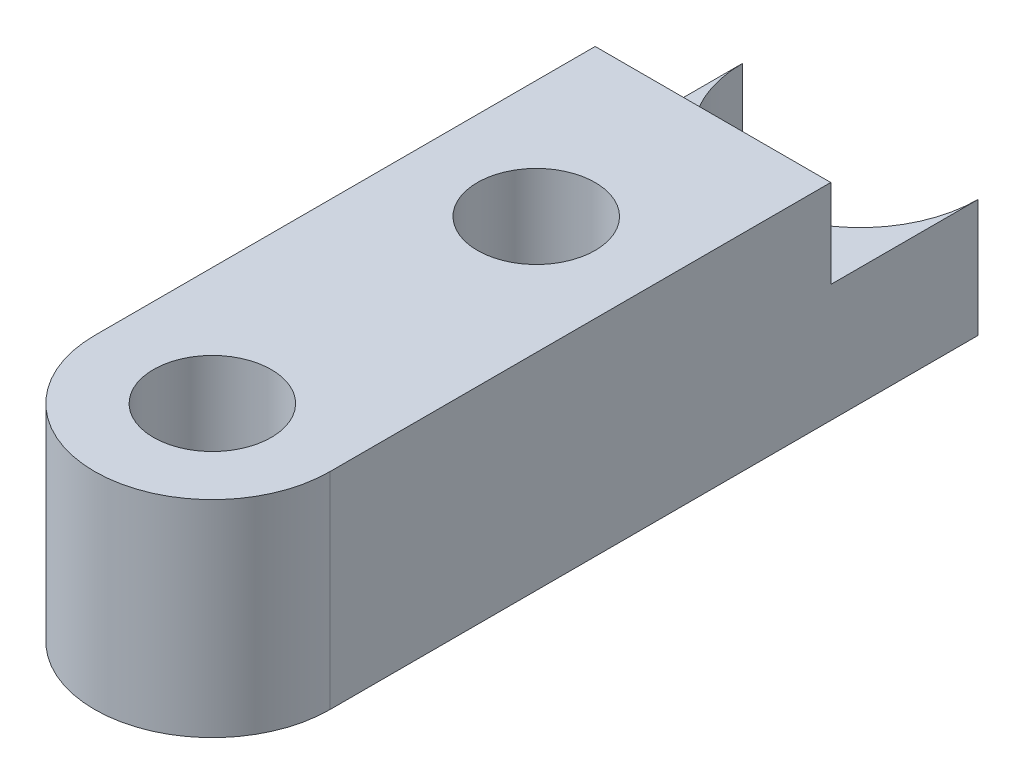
from build123d import *

# Parameters (mm, degrees)
SKETCH1_R           = 1
BOSS_EXTRUDE1_DEPTH = 3.5
SKETCH2_W           = 4
SKETCH2_H           = 2.5
CUT_EXTRUDE1_DEPTH  = 1.5


with BuildPart() as part:
    # Sketch1 → Boss-Extrude1 (new body)
    with BuildSketch(Plane(origin=(0, 0, 0), x_dir=(1, 0, 0), z_dir=(0, 1, 0))):
        with BuildLine():
            Line((-73.01181532, -9.698264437), (-73.01181532, 1.301735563))
            ThreePointArc((-73.01181532, 1.301735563), (-75.01181532, -0.698264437), (-77.01181532, 1.301735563))
            Line((-77.01181532, 1.301735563), (-77.01181532, -9.698264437))
            ThreePointArc((-77.01181532, -9.698264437), (-75.01181532, -11.698264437), (-73.01181532, -9.698264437))
        make_face()
        with Locations(Location((-75.01181532, -9.698264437, 0), (0, 0, 270))):
            Circle(SKETCH1_R, mode=Mode.SUBTRACT)
        with Locations(Location((-75.01181532, -4.198264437, 0), (0, 0, 270))):
            Circle(SKETCH1_R, mode=Mode.SUBTRACT)
    extrude(amount=BOSS_EXTRUDE1_DEPTH)

    # Sketch2 → Cut-Extrude1 (cut)
    with BuildSketch(Plane(origin=(0, 3.5, 0), x_dir=(1, 0, 0), z_dir=(0, 1, 0))):
        with Locations((-75.01181532, 0.051735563)):
            Rectangle(SKETCH2_W, SKETCH2_H)
    extrude(amount=-CUT_EXTRUDE1_DEPTH, mode=Mode.SUBTRACT)


solid = part.part
